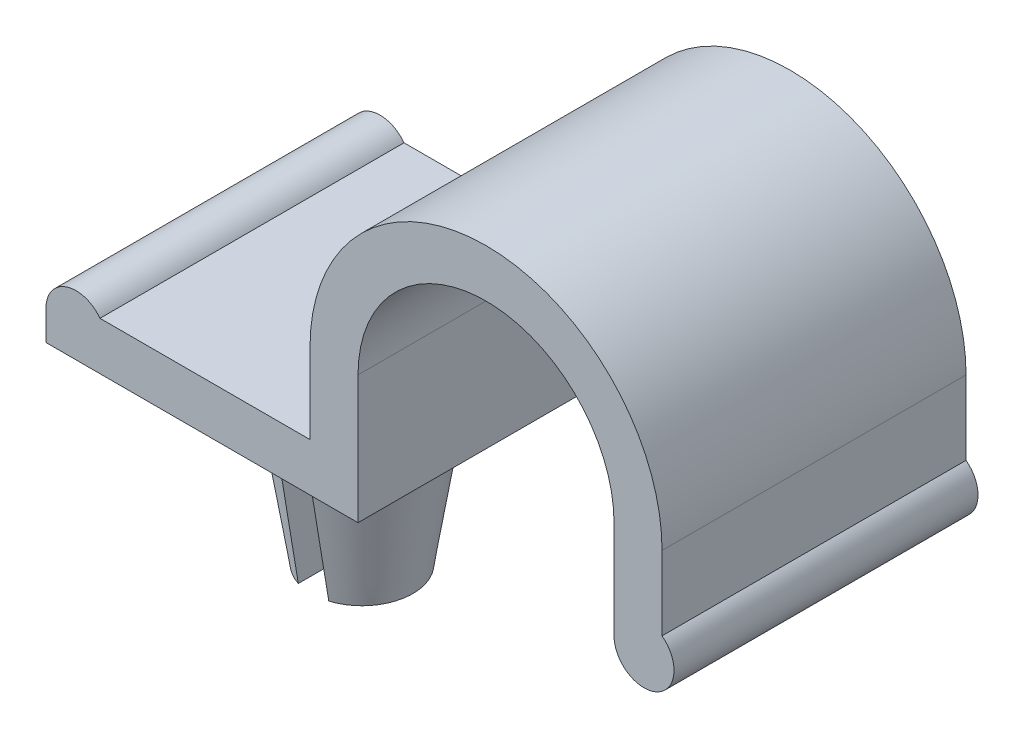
ISO-10303-21;
HEADER;
FILE_DESCRIPTION(('STEP AP214'),'2;1');
FILE_NAME('part.step','',(''),(''),'','','');
FILE_SCHEMA(('AUTOMOTIVE_DESIGN { 1 0 10303 214 1 1 1 1 }'));
ENDSEC;
DATA;
#1=APPLICATION_CONTEXT('core data for automotive mechanical design processes');
#2=APPLICATION_PROTOCOL_DEFINITION('international standard','automotive_design',2000,#1);
#3=PRODUCT_CONTEXT('',#1,'mechanical');
#4=PRODUCT('Part','Part','',(#3));
#5=PRODUCT_RELATED_PRODUCT_CATEGORY('part','',(#4));
#6=PRODUCT_DEFINITION_FORMATION('','',#4);
#7=PRODUCT_DEFINITION_CONTEXT('part definition',#1,'design');
#8=PRODUCT_DEFINITION('design','',#6,#7);
#9=PRODUCT_DEFINITION_SHAPE('','',#8);
#10=(LENGTH_UNIT() NAMED_UNIT(*) SI_UNIT(.MILLI.,.METRE.));
#11=(NAMED_UNIT(*) PLANE_ANGLE_UNIT() SI_UNIT($,.RADIAN.));
#12=(NAMED_UNIT(*) SI_UNIT($,.STERADIAN.) SOLID_ANGLE_UNIT());
#13=UNCERTAINTY_MEASURE_WITH_UNIT(LENGTH_MEASURE(1.E-05),#10,'distance_accuracy_value','');
#14=(GEOMETRIC_REPRESENTATION_CONTEXT(3) GLOBAL_UNCERTAINTY_ASSIGNED_CONTEXT((#13)) GLOBAL_UNIT_ASSIGNED_CONTEXT((#10,
#11,#12)) REPRESENTATION_CONTEXT('',''));
#15=CARTESIAN_POINT('',(0.,0.,0.));
#16=DIRECTION('',(0.,0.,1.));
#17=DIRECTION('',(1.,0.,0.));
#18=AXIS2_PLACEMENT_3D('',#15,#16,#17);
#19=CARTESIAN_POINT('',(-5.15,-4.851,0.));
#20=DIRECTION('',(0.,1.,0.));
#21=DIRECTION('',(0.,0.,1.));
#22=AXIS2_PLACEMENT_3D('',#19,#20,#21);
#23=PLANE('',#22);
#24=DIRECTION('',(0.,0.,1.));
#25=VECTOR('',#24,1.);
#26=CARTESIAN_POINT('',(-7.281,-4.851,0.));
#27=LINE('',#26,#25);
#28=CARTESIAN_POINT('',(-7.281,-4.851,-1.7080219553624));
#29=VERTEX_POINT('',#28);
#30=CARTESIAN_POINT('',(-7.281,-4.851,-1.45080632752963));
#31=VERTEX_POINT('',#30);
#32=EDGE_CURVE('E273',#29,#31,#27,.T.);
#33=ORIENTED_EDGE('',*,*,#32,.F.);
#34=CARTESIAN_POINT('',(-6.9,-4.851,0.));
#35=DIRECTION('',(0.,-1.,0.));
#36=DIRECTION('',(0.,0.,-1.));
#37=AXIS2_PLACEMENT_3D('',#34,#35,#36);
#38=CIRCLE('',#37,1.75);
#39=CARTESIAN_POINT('',(-7.281,-4.851,1.7080219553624));
#40=VERTEX_POINT('',#39);
#41=EDGE_CURVE('E288',#40,#29,#38,.T.);
#42=ORIENTED_EDGE('',*,*,#41,.F.);
#43=CARTESIAN_POINT('',(-7.281,-4.851,1.45080632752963));
#44=VERTEX_POINT('',#43);
#45=EDGE_CURVE('E269',#44,#40,#27,.T.);
#46=ORIENTED_EDGE('',*,*,#45,.F.);
#47=CARTESIAN_POINT('',(-6.9,-4.851,0.));
#48=DIRECTION('',(0.,-1.,0.));
#49=DIRECTION('',(0.,0.,-1.));
#50=AXIS2_PLACEMENT_3D('',#47,#48,#49);
#51=CIRCLE('',#50,1.5);
#52=EDGE_CURVE('E292',#44,#31,#51,.T.);
#53=ORIENTED_EDGE('',*,*,#52,.T.);
#54=EDGE_LOOP('',(#33,#42,#46,#53));
#55=FACE_BOUND('',#54,.T.);
#56=ADVANCED_FACE('F30',(#55),#23,.T.);
#57=CARTESIAN_POINT('',(-6.9,-7.851,0.));
#58=DIRECTION('',(0.,1.,0.));
#59=DIRECTION('',(0.,0.,1.));
#60=AXIS2_PLACEMENT_3D('',#57,#58,#59);
#61=CONICAL_SURFACE('',#60,1.27,0.158655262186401);
#62=CARTESIAN_POINT('',(-7.281,-9.73613459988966,-0.890278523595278));
#63=CARTESIAN_POINT('',(-7.281,-9.46150185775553,-0.938041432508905));
#64=CARTESIAN_POINT('',(-7.281,-9.18678117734,-0.985293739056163));
#65=CARTESIAN_POINT('',(-7.281,-8.63721103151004,-1.07903998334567));
#66=CARTESIAN_POINT('',(-7.281,-8.36236156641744,-1.12553392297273));
#67=CARTESIAN_POINT('',(-7.281,-7.88160254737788,-1.20641442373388));
#68=CARTESIAN_POINT('',(-7.281,-7.67571123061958,-1.24090973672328));
#69=CARTESIAN_POINT('',(-7.281,-7.09190160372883,-1.33840204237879));
#70=CARTESIAN_POINT('',(-7.281,-6.71393986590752,-1.40113905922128));
#71=CARTESIAN_POINT('',(-7.281,-5.95793592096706,-1.5261278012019));
#72=CARTESIAN_POINT('',(-7.281,-5.57989371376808,-1.5883795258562));
#73=CARTESIAN_POINT('',(-7.281,-4.49764082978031,-1.76609832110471));
#74=CARTESIAN_POINT('',(-7.281,-3.79336198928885,-1.88115016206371));
#75=CARTESIAN_POINT('',(-7.281,-2.38469774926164,-2.11060056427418));
#76=CARTESIAN_POINT('',(-7.281,-1.68031234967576,-2.22499912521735));
#77=CARTESIAN_POINT('',(-7.281,-0.271480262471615,-2.45338420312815));
#78=CARTESIAN_POINT('',(-7.281,0.432966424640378,-2.56737072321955));
#79=CARTESIAN_POINT('',(-7.281,1.84190503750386,-2.79505928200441));
#80=CARTESIAN_POINT('',(-7.281,2.5463969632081,-2.9087613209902));
#81=CARTESIAN_POINT('',(-7.281,3.25090153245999,-3.02238458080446));
#82=B_SPLINE_CURVE_WITH_KNOTS('',3,(#62,#63,#64,#65,#66,#67,#68,#69,#70,#71,#72,#73,#74,#75,#76,
#77,#78,#79,#80,#81),.UNSPECIFIED.,.F.,.F.,(4,2,2,2,2,2,2,2,2,4),(0.,0.836263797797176,
1.6725255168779,2.2988084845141,3.44820731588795,4.59760729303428,6.73845001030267,
8.87929373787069,11.0201212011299,13.1609464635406),.UNSPECIFIED.);
#83=CARTESIAN_POINT('',(-7.281,-7.851,-1.21150278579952));
#84=VERTEX_POINT('',#83);
#85=EDGE_CURVE('E275',#84,#29,#82,.T.);
#86=ORIENTED_EDGE('',*,*,#85,.F.);
#87=CARTESIAN_POINT('',(-6.9,-7.851,0.));
#88=DIRECTION('',(0.,-1.,0.));
#89=DIRECTION('',(0.,0.,-1.));
#90=AXIS2_PLACEMENT_3D('',#87,#88,#89);
#91=CIRCLE('',#90,1.27);
#92=CARTESIAN_POINT('',(-7.281,-7.851,1.21150278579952));
#93=VERTEX_POINT('',#92);
#94=EDGE_CURVE('E284',#93,#84,#91,.T.);
#95=ORIENTED_EDGE('',*,*,#94,.F.);
#96=CARTESIAN_POINT('',(-7.281,-9.73613459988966,0.890278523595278));
#97=CARTESIAN_POINT('',(-7.281,-9.46150185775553,0.938041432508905));
#98=CARTESIAN_POINT('',(-7.281,-9.18678117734,0.985293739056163));
#99=CARTESIAN_POINT('',(-7.281,-8.63721103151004,1.07903998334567));
#100=CARTESIAN_POINT('',(-7.281,-8.36236156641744,1.12553392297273));
#101=CARTESIAN_POINT('',(-7.281,-7.88160254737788,1.20641442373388));
#102=CARTESIAN_POINT('',(-7.281,-7.67571123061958,1.24090973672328));
#103=CARTESIAN_POINT('',(-7.281,-7.09190160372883,1.33840204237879));
#104=CARTESIAN_POINT('',(-7.281,-6.71393986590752,1.40113905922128));
#105=CARTESIAN_POINT('',(-7.281,-5.95793592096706,1.5261278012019));
#106=CARTESIAN_POINT('',(-7.281,-5.57989371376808,1.5883795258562));
#107=CARTESIAN_POINT('',(-7.281,-4.49764082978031,1.76609832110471));
#108=CARTESIAN_POINT('',(-7.281,-3.79336198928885,1.88115016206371));
#109=CARTESIAN_POINT('',(-7.281,-2.38469774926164,2.11060056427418));
#110=CARTESIAN_POINT('',(-7.281,-1.68031234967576,2.22499912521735));
#111=CARTESIAN_POINT('',(-7.281,-0.271480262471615,2.45338420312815));
#112=CARTESIAN_POINT('',(-7.281,0.432966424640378,2.56737072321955));
#113=CARTESIAN_POINT('',(-7.281,1.84190503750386,2.79505928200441));
#114=CARTESIAN_POINT('',(-7.281,2.5463969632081,2.9087613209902));
#115=CARTESIAN_POINT('',(-7.281,3.25090153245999,3.02238458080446));
#116=B_SPLINE_CURVE_WITH_KNOTS('',3,(#96,#97,#98,#99,#100,#101,#102,#103,#104,#105,#106,#107,
#108,#109,#110,#111,#112,#113,#114,#115),.UNSPECIFIED.,.F.,.F.,(4,2,2,2,2,2,2,2,2,4),(0.,
0.836263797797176,1.6725255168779,2.2988084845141,3.44820731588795,4.59760729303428,
6.73845001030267,8.87929373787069,11.0201212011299,13.1609464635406),.UNSPECIFIED.);
#117=EDGE_CURVE('E263',#40,#93,#116,.F.);
#118=ORIENTED_EDGE('',*,*,#117,.F.);
#119=ORIENTED_EDGE('',*,*,#41,.T.);
#120=EDGE_LOOP('',(#86,#95,#118,#119));
#121=FACE_BOUND('',#120,.T.);
#122=ADVANCED_FACE('F258',(#121),#61,.T.);
#123=CARTESIAN_POINT('',(-6.9,-7.851,0.));
#124=DIRECTION('',(0.,-1.,0.));
#125=DIRECTION('',(0.,0.,-1.));
#126=AXIS2_PLACEMENT_3D('',#123,#124,#125);
#127=PLANE('',#126);
#128=DIRECTION('',(0.,0.,-1.));
#129=VECTOR('',#128,1.);
#130=CARTESIAN_POINT('',(-7.281,-7.851,0.));
#131=LINE('',#130,#129);
#132=EDGE_CURVE('E210',#93,#84,#131,.T.);
#133=ORIENTED_EDGE('',*,*,#132,.F.);
#134=ORIENTED_EDGE('',*,*,#94,.T.);
#135=EDGE_LOOP('',(#133,#134));
#136=FACE_BOUND('',#135,.T.);
#137=ADVANCED_FACE('F358',(#136),#127,.T.);
#138=CARTESIAN_POINT('',(-3.2,-3.2,3.8));
#139=DIRECTION('',(0.,1.,0.));
#140=DIRECTION('',(-1.,0.,0.));
#141=AXIS2_PLACEMENT_3D('',#138,#139,#140);
#142=PLANE('',#141);
#143=CARTESIAN_POINT('',(-6.9,-3.2,0.));
#144=DIRECTION('',(0.,-1.,0.));
#145=DIRECTION('',(0.,0.,-1.));
#146=AXIS2_PLACEMENT_3D('',#143,#144,#145);
#147=CIRCLE('',#146,1.5);
#148=CARTESIAN_POINT('',(-6.9,-3.2,-1.5));
#149=VERTEX_POINT('',#148);
#150=EDGE_CURVE('E166',#149,#149,#147,.T.);
#151=ORIENTED_EDGE('',*,*,#150,.F.);
#152=EDGE_LOOP('',(#151));
#153=FACE_BOUND('',#152,.T.);
#154=DIRECTION('',(1.,0.,0.));
#155=VECTOR('',#154,1.);
#156=CARTESIAN_POINT('',(-3.2,-3.2,-3.8));
#157=LINE('',#156,#155);
#158=CARTESIAN_POINT('',(-11.,-3.2,-3.8));
#159=VERTEX_POINT('',#158);
#160=CARTESIAN_POINT('',(-3.2,-3.2,-3.8));
#161=VERTEX_POINT('',#160);
#162=EDGE_CURVE('E162',#159,#161,#157,.T.);
#163=ORIENTED_EDGE('',*,*,#162,.T.);
#164=DIRECTION('',(0.,0.,-1.));
#165=VECTOR('',#164,1.);
#166=CARTESIAN_POINT('',(-3.2,-3.2,3.8));
#167=LINE('',#166,#165);
#168=CARTESIAN_POINT('',(-3.2,-3.2,3.8));
#169=VERTEX_POINT('',#168);
#170=EDGE_CURVE('E206',#169,#161,#167,.T.);
#171=ORIENTED_EDGE('',*,*,#170,.F.);
#172=DIRECTION('',(1.,0.,0.));
#173=VECTOR('',#172,1.);
#174=CARTESIAN_POINT('',(-3.2,-3.2,3.8));
#175=LINE('',#174,#173);
#176=CARTESIAN_POINT('',(-11.,-3.2,3.8));
#177=VERTEX_POINT('',#176);
#178=EDGE_CURVE('E184',#177,#169,#175,.T.);
#179=ORIENTED_EDGE('',*,*,#178,.F.);
#180=DIRECTION('',(0.,0.,-1.));
#181=VECTOR('',#180,1.);
#182=CARTESIAN_POINT('',(-11.,-3.2,3.8));
#183=LINE('',#182,#181);
#184=EDGE_CURVE('E158',#177,#159,#183,.T.);
#185=ORIENTED_EDGE('',*,*,#184,.T.);
#186=EDGE_LOOP('',(#163,#171,#179,#185));
#187=FACE_BOUND('',#186,.T.);
#188=ADVANCED_FACE('F32',(#153,#187),#142,.F.);
#189=CARTESIAN_POINT('',(-3.2,0.,3.8));
#190=DIRECTION('',(-1.,0.,0.));
#191=DIRECTION('',(0.,-1.,0.));
#192=AXIS2_PLACEMENT_3D('',#189,#190,#191);
#193=PLANE('',#192);
#194=DIRECTION('',(0.,1.,0.));
#195=VECTOR('',#194,1.);
#196=CARTESIAN_POINT('',(-3.2,0.,-3.8));
#197=LINE('',#196,#195);
#198=CARTESIAN_POINT('',(-3.2,0.,-3.8));
#199=VERTEX_POINT('',#198);
#200=EDGE_CURVE('E165',#161,#199,#197,.T.);
#201=ORIENTED_EDGE('',*,*,#200,.T.);
#202=DIRECTION('',(0.,0.,-1.));
#203=VECTOR('',#202,1.);
#204=CARTESIAN_POINT('',(-3.2,0.,3.8));
#205=LINE('',#204,#203);
#206=CARTESIAN_POINT('',(-3.2,0.,3.8));
#207=VERTEX_POINT('',#206);
#208=EDGE_CURVE('E203',#207,#199,#205,.T.);
#209=ORIENTED_EDGE('',*,*,#208,.F.);
#210=DIRECTION('',(0.,1.,0.));
#211=VECTOR('',#210,1.);
#212=CARTESIAN_POINT('',(-3.2,0.,3.8));
#213=LINE('',#212,#211);
#214=EDGE_CURVE('E110',#169,#207,#213,.T.);
#215=ORIENTED_EDGE('',*,*,#214,.F.);
#216=ORIENTED_EDGE('',*,*,#170,.T.);
#217=EDGE_LOOP('',(#201,#209,#215,#216));
#218=FACE_BOUND('',#217,.T.);
#219=ADVANCED_FACE('F328',(#218),#193,.F.);
#220=CARTESIAN_POINT('',(0.,0.,3.8));
#221=DIRECTION('',(0.,0.,-1.));
#222=DIRECTION('',(-1.,0.,0.));
#223=AXIS2_PLACEMENT_3D('',#220,#221,#222);
#224=CYLINDRICAL_SURFACE('',#223,3.2);
#225=CARTESIAN_POINT('',(0.,0.,-3.8));
#226=DIRECTION('',(0.,0.,-1.));
#227=DIRECTION('',(1.,0.,0.));
#228=AXIS2_PLACEMENT_3D('',#225,#226,#227);
#229=CIRCLE('',#228,3.2);
#230=CARTESIAN_POINT('',(3.2,0.,-3.8));
#231=VERTEX_POINT('',#230);
#232=EDGE_CURVE('E168',#199,#231,#229,.T.);
#233=ORIENTED_EDGE('',*,*,#232,.T.);
#234=DIRECTION('',(0.,0.,-1.));
#235=VECTOR('',#234,1.);
#236=CARTESIAN_POINT('',(3.2,0.,3.8));
#237=LINE('',#236,#235);
#238=CARTESIAN_POINT('',(3.2,0.,3.8));
#239=VERTEX_POINT('',#238);
#240=EDGE_CURVE('E200',#239,#231,#237,.T.);
#241=ORIENTED_EDGE('',*,*,#240,.F.);
#242=CARTESIAN_POINT('',(0.,0.,3.8));
#243=DIRECTION('',(0.,0.,-1.));
#244=DIRECTION('',(1.,0.,0.));
#245=AXIS2_PLACEMENT_3D('',#242,#243,#244);
#246=CIRCLE('',#245,3.2);
#247=EDGE_CURVE('E300',#207,#239,#246,.T.);
#248=ORIENTED_EDGE('',*,*,#247,.F.);
#249=ORIENTED_EDGE('',*,*,#208,.T.);
#250=EDGE_LOOP('',(#233,#241,#248,#249));
#251=FACE_BOUND('',#250,.T.);
#252=ADVANCED_FACE('F331',(#251),#224,.F.);
#253=CARTESIAN_POINT('',(3.2,0.,3.8));
#254=DIRECTION('',(1.,0.,0.));
#255=DIRECTION('',(0.,1.,0.));
#256=AXIS2_PLACEMENT_3D('',#253,#254,#255);
#257=PLANE('',#256);
#258=DIRECTION('',(0.,-1.,0.));
#259=VECTOR('',#258,1.);
#260=CARTESIAN_POINT('',(3.2,0.,-3.8));
#261=LINE('',#260,#259);
#262=CARTESIAN_POINT('',(3.2,-2.45,-3.8));
#263=VERTEX_POINT('',#262);
#264=EDGE_CURVE('E170',#231,#263,#261,.T.);
#265=ORIENTED_EDGE('',*,*,#264,.T.);
#266=DIRECTION('',(0.,0.,-1.));
#267=VECTOR('',#266,1.);
#268=CARTESIAN_POINT('',(3.2,-2.45,3.8));
#269=LINE('',#268,#267);
#270=CARTESIAN_POINT('',(3.2,-2.45,3.8));
#271=VERTEX_POINT('',#270);
#272=EDGE_CURVE('E197',#271,#263,#269,.T.);
#273=ORIENTED_EDGE('',*,*,#272,.F.);
#274=DIRECTION('',(0.,-1.,0.));
#275=VECTOR('',#274,1.);
#276=CARTESIAN_POINT('',(3.2,0.,3.8));
#277=LINE('',#276,#275);
#278=EDGE_CURVE('E302',#239,#271,#277,.T.);
#279=ORIENTED_EDGE('',*,*,#278,.F.);
#280=ORIENTED_EDGE('',*,*,#240,.T.);
#281=EDGE_LOOP('',(#265,#273,#279,#280));
#282=FACE_BOUND('',#281,.T.);
#283=ADVANCED_FACE('F336',(#282),#257,.F.);
#284=CARTESIAN_POINT('',(3.95,-2.45,3.8));
#285=DIRECTION('',(0.,0.,-1.));
#286=DIRECTION('',(-1.,0.,0.));
#287=AXIS2_PLACEMENT_3D('',#284,#285,#286);
#288=CYLINDRICAL_SURFACE('',#287,0.75);
#289=CARTESIAN_POINT('',(3.95,-2.45,-3.8));
#290=DIRECTION('',(0.,0.,1.));
#291=DIRECTION('',(1.,0.,0.));
#292=AXIS2_PLACEMENT_3D('',#289,#290,#291);
#293=CIRCLE('',#292,0.75);
#294=CARTESIAN_POINT('',(4.4,-1.85,-3.8));
#295=VERTEX_POINT('',#294);
#296=EDGE_CURVE('E172',#263,#295,#293,.T.);
#297=ORIENTED_EDGE('',*,*,#296,.T.);
#298=DIRECTION('',(0.,0.,-1.));
#299=VECTOR('',#298,1.);
#300=CARTESIAN_POINT('',(4.4,-1.85,3.8));
#301=LINE('',#300,#299);
#302=CARTESIAN_POINT('',(4.4,-1.85,3.8));
#303=VERTEX_POINT('',#302);
#304=EDGE_CURVE('E194',#303,#295,#301,.T.);
#305=ORIENTED_EDGE('',*,*,#304,.F.);
#306=CARTESIAN_POINT('',(3.95,-2.45,3.8));
#307=DIRECTION('',(0.,0.,1.));
#308=DIRECTION('',(1.,0.,0.));
#309=AXIS2_PLACEMENT_3D('',#306,#307,#308);
#310=CIRCLE('',#309,0.75);
#311=EDGE_CURVE('E304',#271,#303,#310,.T.);
#312=ORIENTED_EDGE('',*,*,#311,.F.);
#313=ORIENTED_EDGE('',*,*,#272,.T.);
#314=EDGE_LOOP('',(#297,#305,#312,#313));
#315=FACE_BOUND('',#314,.T.);
#316=ADVANCED_FACE('F340',(#315),#288,.T.);
#317=CARTESIAN_POINT('',(4.4,0.,3.8));
#318=DIRECTION('',(-1.,0.,0.));
#319=DIRECTION('',(0.,0.,1.));
#320=AXIS2_PLACEMENT_3D('',#317,#318,#319);
#321=PLANE('',#320);
#322=DIRECTION('',(0.,1.,0.));
#323=VECTOR('',#322,1.);
#324=CARTESIAN_POINT('',(4.4,0.,-3.8));
#325=LINE('',#324,#323);
#326=CARTESIAN_POINT('',(4.4,0.,-3.8));
#327=VERTEX_POINT('',#326);
#328=EDGE_CURVE('E174',#295,#327,#325,.T.);
#329=ORIENTED_EDGE('',*,*,#328,.T.);
#330=DIRECTION('',(0.,0.,-1.));
#331=VECTOR('',#330,1.);
#332=CARTESIAN_POINT('',(4.4,0.,3.8));
#333=LINE('',#332,#331);
#334=CARTESIAN_POINT('',(4.4,0.,3.8));
#335=VERTEX_POINT('',#334);
#336=EDGE_CURVE('E191',#335,#327,#333,.T.);
#337=ORIENTED_EDGE('',*,*,#336,.F.);
#338=DIRECTION('',(0.,1.,0.));
#339=VECTOR('',#338,1.);
#340=CARTESIAN_POINT('',(4.4,0.,3.8));
#341=LINE('',#340,#339);
#342=EDGE_CURVE('E306',#303,#335,#341,.T.);
#343=ORIENTED_EDGE('',*,*,#342,.F.);
#344=ORIENTED_EDGE('',*,*,#304,.T.);
#345=EDGE_LOOP('',(#329,#337,#343,#344));
#346=FACE_BOUND('',#345,.T.);
#347=ADVANCED_FACE('F344',(#346),#321,.F.);
#348=CARTESIAN_POINT('',(0.,0.,3.8));
#349=DIRECTION('',(0.,0.,-1.));
#350=DIRECTION('',(-1.,0.,0.));
#351=AXIS2_PLACEMENT_3D('',#348,#349,#350);
#352=CYLINDRICAL_SURFACE('',#351,4.4);
#353=CARTESIAN_POINT('',(0.,0.,-3.8));
#354=DIRECTION('',(0.,0.,1.));
#355=DIRECTION('',(1.,0.,0.));
#356=AXIS2_PLACEMENT_3D('',#353,#354,#355);
#357=CIRCLE('',#356,4.4);
#358=CARTESIAN_POINT('',(-4.4,0.,-3.8));
#359=VERTEX_POINT('',#358);
#360=EDGE_CURVE('E176',#327,#359,#357,.T.);
#361=ORIENTED_EDGE('',*,*,#360,.T.);
#362=DIRECTION('',(0.,0.,-1.));
#363=VECTOR('',#362,1.);
#364=CARTESIAN_POINT('',(-4.4,0.,3.8));
#365=LINE('',#364,#363);
#366=CARTESIAN_POINT('',(-4.4,0.,3.8));
#367=VERTEX_POINT('',#366);
#368=EDGE_CURVE('E188',#367,#359,#365,.T.);
#369=ORIENTED_EDGE('',*,*,#368,.F.);
#370=CARTESIAN_POINT('',(0.,0.,3.8));
#371=DIRECTION('',(0.,0.,1.));
#372=DIRECTION('',(1.,0.,0.));
#373=AXIS2_PLACEMENT_3D('',#370,#371,#372);
#374=CIRCLE('',#373,4.4);
#375=EDGE_CURVE('E308',#335,#367,#374,.T.);
#376=ORIENTED_EDGE('',*,*,#375,.F.);
#377=ORIENTED_EDGE('',*,*,#336,.T.);
#378=EDGE_LOOP('',(#361,#369,#376,#377));
#379=FACE_BOUND('',#378,.T.);
#380=ADVANCED_FACE('F314',(#379),#352,.T.);
#381=CARTESIAN_POINT('',(-4.4,0.,3.8));
#382=DIRECTION('',(1.,0.,0.));
#383=DIRECTION('',(0.,0.,-1.));
#384=AXIS2_PLACEMENT_3D('',#381,#382,#383);
#385=PLANE('',#384);
#386=DIRECTION('',(0.,-1.,0.));
#387=VECTOR('',#386,1.);
#388=CARTESIAN_POINT('',(-4.4,0.,-3.8));
#389=LINE('',#388,#387);
#390=CARTESIAN_POINT('',(-4.4,-2.,-3.8));
#391=VERTEX_POINT('',#390);
#392=EDGE_CURVE('E178',#359,#391,#389,.T.);
#393=ORIENTED_EDGE('',*,*,#392,.T.);
#394=DIRECTION('',(0.,0.,-1.));
#395=VECTOR('',#394,1.);
#396=CARTESIAN_POINT('',(-4.4,-2.,3.8));
#397=LINE('',#396,#395);
#398=CARTESIAN_POINT('',(-4.4,-2.,3.8));
#399=VERTEX_POINT('',#398);
#400=EDGE_CURVE('E153',#399,#391,#397,.T.);
#401=ORIENTED_EDGE('',*,*,#400,.F.);
#402=DIRECTION('',(0.,-1.,0.));
#403=VECTOR('',#402,1.);
#404=CARTESIAN_POINT('',(-4.4,0.,3.8));
#405=LINE('',#404,#403);
#406=EDGE_CURVE('E141',#367,#399,#405,.T.);
#407=ORIENTED_EDGE('',*,*,#406,.F.);
#408=ORIENTED_EDGE('',*,*,#368,.T.);
#409=EDGE_LOOP('',(#393,#401,#407,#408));
#410=FACE_BOUND('',#409,.T.);
#411=ADVANCED_FACE('F318',(#410),#385,.F.);
#412=CARTESIAN_POINT('',(-9.65,-2.,3.8));
#413=DIRECTION('',(0.,-1.,0.));
#414=DIRECTION('',(0.,0.,-1.));
#415=AXIS2_PLACEMENT_3D('',#412,#413,#414);
#416=PLANE('',#415);
#417=DIRECTION('',(-1.,0.,0.));
#418=VECTOR('',#417,1.);
#419=CARTESIAN_POINT('',(-9.65,-2.,-3.8));
#420=LINE('',#419,#418);
#421=CARTESIAN_POINT('',(-9.65,-2.,-3.8));
#422=VERTEX_POINT('',#421);
#423=EDGE_CURVE('E150',#391,#422,#420,.T.);
#424=ORIENTED_EDGE('',*,*,#423,.T.);
#425=DIRECTION('',(0.,0.,-1.));
#426=VECTOR('',#425,1.);
#427=CARTESIAN_POINT('',(-9.65,-2.,3.8));
#428=LINE('',#427,#426);
#429=CARTESIAN_POINT('',(-9.65,-2.,3.8));
#430=VERTEX_POINT('',#429);
#431=EDGE_CURVE('E147',#430,#422,#428,.T.);
#432=ORIENTED_EDGE('',*,*,#431,.F.);
#433=DIRECTION('',(-1.,0.,0.));
#434=VECTOR('',#433,1.);
#435=CARTESIAN_POINT('',(-9.65,-2.,3.8));
#436=LINE('',#435,#434);
#437=EDGE_CURVE('E134',#399,#430,#436,.T.);
#438=ORIENTED_EDGE('',*,*,#437,.F.);
#439=ORIENTED_EDGE('',*,*,#400,.T.);
#440=EDGE_LOOP('',(#424,#432,#438,#439));
#441=FACE_BOUND('',#440,.T.);
#442=ADVANCED_FACE('F148',(#441),#416,.F.);
#443=CARTESIAN_POINT('',(-10.25,-2.45,3.8));
#444=DIRECTION('',(0.,0.,-1.));
#445=DIRECTION('',(-1.,0.,0.));
#446=AXIS2_PLACEMENT_3D('',#443,#444,#445);
#447=CYLINDRICAL_SURFACE('',#446,0.750000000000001);
#448=CARTESIAN_POINT('',(-10.25,-2.45,-3.8));
#449=DIRECTION('',(0.,0.,1.));
#450=DIRECTION('',(1.,0.,0.));
#451=AXIS2_PLACEMENT_3D('',#448,#449,#450);
#452=CIRCLE('',#451,0.750000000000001);
#453=CARTESIAN_POINT('',(-11.,-2.45,-3.8));
#454=VERTEX_POINT('',#453);
#455=EDGE_CURVE('E181',#422,#454,#452,.T.);
#456=ORIENTED_EDGE('',*,*,#455,.T.);
#457=DIRECTION('',(0.,0.,-1.));
#458=VECTOR('',#457,1.);
#459=CARTESIAN_POINT('',(-11.,-2.45,3.8));
#460=LINE('',#459,#458);
#461=CARTESIAN_POINT('',(-11.,-2.45,3.8));
#462=VERTEX_POINT('',#461);
#463=EDGE_CURVE('E154',#462,#454,#460,.T.);
#464=ORIENTED_EDGE('',*,*,#463,.F.);
#465=CARTESIAN_POINT('',(-10.25,-2.45,3.8));
#466=DIRECTION('',(0.,0.,1.));
#467=DIRECTION('',(1.,0.,0.));
#468=AXIS2_PLACEMENT_3D('',#465,#466,#467);
#469=CIRCLE('',#468,0.750000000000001);
#470=EDGE_CURVE('E138',#430,#462,#469,.T.);
#471=ORIENTED_EDGE('',*,*,#470,.F.);
#472=ORIENTED_EDGE('',*,*,#431,.T.);
#473=EDGE_LOOP('',(#456,#464,#471,#472));
#474=FACE_BOUND('',#473,.T.);
#475=ADVANCED_FACE('F156',(#474),#447,.T.);
#476=CARTESIAN_POINT('',(-11.,-3.2,3.8));
#477=DIRECTION('',(1.,0.,0.));
#478=DIRECTION('',(0.,0.,-1.));
#479=AXIS2_PLACEMENT_3D('',#476,#477,#478);
#480=PLANE('',#479);
#481=DIRECTION('',(0.,-1.,0.));
#482=VECTOR('',#481,1.);
#483=CARTESIAN_POINT('',(-11.,-3.2,-3.8));
#484=LINE('',#483,#482);
#485=EDGE_CURVE('E101',#454,#159,#484,.T.);
#486=ORIENTED_EDGE('',*,*,#485,.T.);
#487=ORIENTED_EDGE('',*,*,#184,.F.);
#488=DIRECTION('',(0.,-1.,0.));
#489=VECTOR('',#488,1.);
#490=CARTESIAN_POINT('',(-11.,-3.2,3.8));
#491=LINE('',#490,#489);
#492=EDGE_CURVE('E59',#462,#177,#491,.T.);
#493=ORIENTED_EDGE('',*,*,#492,.F.);
#494=ORIENTED_EDGE('',*,*,#463,.T.);
#495=EDGE_LOOP('',(#486,#487,#493,#494));
#496=FACE_BOUND('',#495,.T.);
#497=ADVANCED_FACE('F322',(#496),#480,.F.);
#498=CARTESIAN_POINT('',(-10.25,-2.45,3.8));
#499=DIRECTION('',(0.,0.,1.));
#500=DIRECTION('',(1.,0.,0.));
#501=AXIS2_PLACEMENT_3D('',#498,#499,#500);
#502=PLANE('',#501);
#503=ORIENTED_EDGE('',*,*,#178,.T.);
#504=ORIENTED_EDGE('',*,*,#214,.T.);
#505=ORIENTED_EDGE('',*,*,#247,.T.);
#506=ORIENTED_EDGE('',*,*,#278,.T.);
#507=ORIENTED_EDGE('',*,*,#311,.T.);
#508=ORIENTED_EDGE('',*,*,#342,.T.);
#509=ORIENTED_EDGE('',*,*,#375,.T.);
#510=ORIENTED_EDGE('',*,*,#406,.T.);
#511=ORIENTED_EDGE('',*,*,#437,.T.);
#512=ORIENTED_EDGE('',*,*,#470,.T.);
#513=ORIENTED_EDGE('',*,*,#492,.T.);
#514=EDGE_LOOP('',(#503,#504,#505,#506,#507,#508,#509,#510,#511,#512,#513));
#515=FACE_BOUND('',#514,.T.);
#516=ADVANCED_FACE('F136',(#515),#502,.T.);
#517=CARTESIAN_POINT('',(-10.25,-2.45,-3.8));
#518=DIRECTION('',(0.,0.,1.));
#519=DIRECTION('',(1.,0.,0.));
#520=AXIS2_PLACEMENT_3D('',#517,#518,#519);
#521=PLANE('',#520);
#522=ORIENTED_EDGE('',*,*,#162,.F.);
#523=ORIENTED_EDGE('',*,*,#485,.F.);
#524=ORIENTED_EDGE('',*,*,#455,.F.);
#525=ORIENTED_EDGE('',*,*,#423,.F.);
#526=ORIENTED_EDGE('',*,*,#392,.F.);
#527=ORIENTED_EDGE('',*,*,#360,.F.);
#528=ORIENTED_EDGE('',*,*,#328,.F.);
#529=ORIENTED_EDGE('',*,*,#296,.F.);
#530=ORIENTED_EDGE('',*,*,#264,.F.);
#531=ORIENTED_EDGE('',*,*,#232,.F.);
#532=ORIENTED_EDGE('',*,*,#200,.F.);
#533=EDGE_LOOP('',(#522,#523,#524,#525,#526,#527,#528,#529,#530,#531,#532));
#534=FACE_BOUND('',#533,.T.);
#535=ADVANCED_FACE('F321',(#534),#521,.F.);
#536=CARTESIAN_POINT('',(-6.9,-3.2,0.));
#537=DIRECTION('',(0.,-1.,0.));
#538=DIRECTION('',(0.,0.,-1.));
#539=AXIS2_PLACEMENT_3D('',#536,#537,#538);
#540=CYLINDRICAL_SURFACE('',#539,1.5);
#541=DIRECTION('',(0.,-1.,0.));
#542=VECTOR('',#541,1.);
#543=CARTESIAN_POINT('',(-7.281,-3.2,1.45080632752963));
#544=LINE('',#543,#542);
#545=CARTESIAN_POINT('',(-7.281,-3.787,1.45080632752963));
#546=VERTEX_POINT('',#545);
#547=EDGE_CURVE('E272',#546,#44,#544,.T.);
#548=ORIENTED_EDGE('',*,*,#547,.F.);
#549=CARTESIAN_POINT('',(-6.519,-3.787,1.45080632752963));
#550=CARTESIAN_POINT('',(-6.51898021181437,-3.76593359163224,1.45078805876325));
#551=CARTESIAN_POINT('',(-6.52074585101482,-3.74488063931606,1.4512647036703));
#552=CARTESIAN_POINT('',(-6.52769226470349,-3.70342626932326,1.45306907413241));
#553=CARTESIAN_POINT('',(-6.53286595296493,-3.68302359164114,1.45439503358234));
#554=CARTESIAN_POINT('',(-6.54647314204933,-3.64340447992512,1.45776015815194));
#555=CARTESIAN_POINT('',(-6.5549062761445,-3.62418791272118,1.45979924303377));
#556=CARTESIAN_POINT('',(-6.57477546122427,-3.5874346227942,1.46435421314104));
#557=CARTESIAN_POINT('',(-6.58621236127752,-3.56989837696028,1.46687023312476));
#558=CARTESIAN_POINT('',(-6.61204069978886,-3.53661386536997,1.47216033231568));
#559=CARTESIAN_POINT('',(-6.62648748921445,-3.52090920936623,1.47493861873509));
#560=CARTESIAN_POINT('',(-6.65780717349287,-3.49211663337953,1.48040366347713));
#561=CARTESIAN_POINT('',(-6.67468045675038,-3.47902913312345,1.48309040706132));
#562=CARTESIAN_POINT('',(-6.71067518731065,-3.45566331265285,1.4881164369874));
#563=CARTESIAN_POINT('',(-6.72982555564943,-3.44542824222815,1.49045015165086));
#564=CARTESIAN_POINT('',(-6.76964325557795,-3.42833965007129,1.49445872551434));
#565=CARTESIAN_POINT('',(-6.79031028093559,-3.42148544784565,1.49613371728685));
#566=CARTESIAN_POINT('',(-6.83211775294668,-3.41149336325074,1.49860640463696));
#567=CARTESIAN_POINT('',(-6.85323931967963,-3.40828091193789,1.49942167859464));
#568=CARTESIAN_POINT('',(-6.89573673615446,-3.40542930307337,1.5001443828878));
#569=CARTESIAN_POINT('',(-6.91711255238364,-3.40578967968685,1.50005193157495));
#570=CARTESIAN_POINT('',(-6.95899311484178,-3.41002026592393,1.49898260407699));
#571=CARTESIAN_POINT('',(-6.97950659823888,-3.41380989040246,1.49802603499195));
#572=CARTESIAN_POINT('',(-7.0195961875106,-3.4246616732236,1.49535968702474));
#573=CARTESIAN_POINT('',(-7.03917225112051,-3.43172397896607,1.49364987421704));
#574=CARTESIAN_POINT('',(-7.0770425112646,-3.44898512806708,1.48963828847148));
#575=CARTESIAN_POINT('',(-7.09532314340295,-3.45921243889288,1.48733117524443));
#576=CARTESIAN_POINT('',(-7.12993633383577,-3.48249144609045,1.48237493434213));
#577=CARTESIAN_POINT('',(-7.14626858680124,-3.49554358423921,1.47972575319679));
#578=CARTESIAN_POINT('',(-7.17700086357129,-3.52453095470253,1.47428665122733));
#579=CARTESIAN_POINT('',(-7.19133450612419,-3.54053628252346,1.47149486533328));
#580=CARTESIAN_POINT('',(-7.2171327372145,-3.5747572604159,1.46615174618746));
#581=CARTESIAN_POINT('',(-7.2285965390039,-3.59297351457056,1.46360047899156));
#582=CARTESIAN_POINT('',(-7.24837495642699,-3.63123567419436,1.45901985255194));
#583=CARTESIAN_POINT('',(-7.25667133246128,-3.65129137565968,1.45699353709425));
#584=CARTESIAN_POINT('',(-7.26974312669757,-3.69256510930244,1.45373180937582));
#585=CARTESIAN_POINT('',(-7.27452381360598,-3.71378135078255,1.45249521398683));
#586=CARTESIAN_POINT('',(-7.27864467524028,-3.74381872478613,1.45142316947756));
#587=CARTESIAN_POINT('',(-7.27952805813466,-3.75243679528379,1.45119222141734));
#588=CARTESIAN_POINT('',(-7.28070506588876,-3.76970187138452,1.45088386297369));
#589=CARTESIAN_POINT('',(-7.28099964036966,-3.77834880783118,1.45080620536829));
#590=CARTESIAN_POINT('',(-7.28100000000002,-3.78700000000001,1.45080632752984));
#591=B_SPLINE_CURVE_WITH_KNOTS('',3,(#549,#550,#551,#552,#553,#554,#555,#556,#557,#558,#559,
#560,#561,#562,#563,#564,#565,#566,#567,#568,#569,#570,#571,#572,#573,#574,#575,#576,#577,#578,
#579,#580,#581,#582,#583,#584,#585,#586,#587,#588,#589,#590),.UNSPECIFIED.,.F.,.F.,(4,2,2,2,2,2,
2,2,2,2,2,2,2,2,2,2,2,2,2,2,4),(0.,0.0630992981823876,0.126067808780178,0.189029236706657,
0.252008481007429,0.316268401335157,0.380538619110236,0.445736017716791,0.510920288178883,
0.574744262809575,0.638559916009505,0.700913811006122,0.763270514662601,0.82620523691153,
0.88914980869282,0.953845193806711,1.01855829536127,1.0836386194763,1.14862121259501,
1.17460290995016,1.20054267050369),.UNSPECIFIED.);
#592=CARTESIAN_POINT('',(-6.519,-3.787,1.45080632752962));
#593=VERTEX_POINT('',#592);
#594=EDGE_CURVE('E11',#593,#546,#591,.T.);
#595=ORIENTED_EDGE('',*,*,#594,.F.);
#596=DIRECTION('',(0.,-1.,0.));
#597=VECTOR('',#596,1.);
#598=CARTESIAN_POINT('',(-6.519,-3.2,1.45080632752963));
#599=LINE('',#598,#597);
#600=CARTESIAN_POINT('',(-6.519,-4.851,1.45080632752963));
#601=VERTEX_POINT('',#600);
#602=EDGE_CURVE('E249',#601,#593,#599,.F.);
#603=ORIENTED_EDGE('',*,*,#602,.F.);
#604=CARTESIAN_POINT('',(-6.519,-4.851,-1.45080632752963));
#605=VERTEX_POINT('',#604);
#606=EDGE_CURVE('E293',#605,#601,#51,.T.);
#607=ORIENTED_EDGE('',*,*,#606,.F.);
#608=DIRECTION('',(0.,-1.,0.));
#609=VECTOR('',#608,1.);
#610=CARTESIAN_POINT('',(-6.519,-3.2,-1.45080632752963));
#611=LINE('',#610,#609);
#612=CARTESIAN_POINT('',(-6.519,-3.787,-1.45080632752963));
#613=VERTEX_POINT('',#612);
#614=EDGE_CURVE('E250',#613,#605,#611,.T.);
#615=ORIENTED_EDGE('',*,*,#614,.F.);
#616=CARTESIAN_POINT('',(-7.281,-3.787,-1.45080632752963));
#617=CARTESIAN_POINT('',(-7.28101978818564,-3.76593359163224,-1.45078805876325));
#618=CARTESIAN_POINT('',(-7.27925414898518,-3.74488063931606,-1.4512647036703));
#619=CARTESIAN_POINT('',(-7.27230773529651,-3.70342626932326,-1.45306907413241));
#620=CARTESIAN_POINT('',(-7.26713404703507,-3.68302359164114,-1.45439503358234));
#621=CARTESIAN_POINT('',(-7.25352685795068,-3.64340447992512,-1.45776015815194));
#622=CARTESIAN_POINT('',(-7.2450937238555,-3.62418791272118,-1.45979924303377));
#623=CARTESIAN_POINT('',(-7.22522453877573,-3.5874346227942,-1.46435421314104));
#624=CARTESIAN_POINT('',(-7.21378763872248,-3.56989837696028,-1.46687023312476));
#625=CARTESIAN_POINT('',(-7.18795930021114,-3.53661386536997,-1.47216033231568));
#626=CARTESIAN_POINT('',(-7.17351251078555,-3.52090920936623,-1.47493861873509));
#627=CARTESIAN_POINT('',(-7.14219282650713,-3.49211663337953,-1.48040366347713));
#628=CARTESIAN_POINT('',(-7.12531954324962,-3.47902913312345,-1.48309040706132));
#629=CARTESIAN_POINT('',(-7.08932481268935,-3.45566331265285,-1.4881164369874));
#630=CARTESIAN_POINT('',(-7.07017444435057,-3.44542824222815,-1.49045015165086));
#631=CARTESIAN_POINT('',(-7.03035674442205,-3.42833965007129,-1.49445872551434));
#632=CARTESIAN_POINT('',(-7.00968971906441,-3.42148544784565,-1.49613371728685));
#633=CARTESIAN_POINT('',(-6.96788224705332,-3.41149336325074,-1.49860640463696));
#634=CARTESIAN_POINT('',(-6.94676068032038,-3.40828091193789,-1.49942167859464));
#635=CARTESIAN_POINT('',(-6.90426326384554,-3.40542930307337,-1.5001443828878));
#636=CARTESIAN_POINT('',(-6.88288744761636,-3.40578967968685,-1.50005193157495));
#637=CARTESIAN_POINT('',(-6.84100688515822,-3.41002026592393,-1.49898260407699));
#638=CARTESIAN_POINT('',(-6.82049340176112,-3.41380989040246,-1.49802603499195));
#639=CARTESIAN_POINT('',(-6.7804038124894,-3.4246616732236,-1.49535968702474));
#640=CARTESIAN_POINT('',(-6.76082774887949,-3.43172397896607,-1.49364987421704));
#641=CARTESIAN_POINT('',(-6.72295748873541,-3.44898512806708,-1.48963828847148));
#642=CARTESIAN_POINT('',(-6.70467685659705,-3.45921243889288,-1.48733117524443));
#643=CARTESIAN_POINT('',(-6.67006366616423,-3.48249144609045,-1.48237493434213));
#644=CARTESIAN_POINT('',(-6.65373141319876,-3.49554358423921,-1.47972575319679));
#645=CARTESIAN_POINT('',(-6.62299913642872,-3.52453095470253,-1.47428665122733));
#646=CARTESIAN_POINT('',(-6.60866549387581,-3.54053628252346,-1.47149486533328));
#647=CARTESIAN_POINT('',(-6.5828672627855,-3.5747572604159,-1.46615174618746));
#648=CARTESIAN_POINT('',(-6.5714034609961,-3.59297351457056,-1.46360047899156));
#649=CARTESIAN_POINT('',(-6.55162504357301,-3.63123567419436,-1.45901985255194));
#650=CARTESIAN_POINT('',(-6.54332866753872,-3.65129137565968,-1.45699353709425));
#651=CARTESIAN_POINT('',(-6.53025687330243,-3.69256510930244,-1.45373180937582));
#652=CARTESIAN_POINT('',(-6.52547618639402,-3.71378135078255,-1.45249521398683));
#653=CARTESIAN_POINT('',(-6.52135532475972,-3.74381872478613,-1.45142316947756));
#654=CARTESIAN_POINT('',(-6.52047194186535,-3.75243679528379,-1.45119222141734));
#655=CARTESIAN_POINT('',(-6.51929493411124,-3.76970187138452,-1.45088386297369));
#656=CARTESIAN_POINT('',(-6.51900035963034,-3.77834880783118,-1.45080620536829));
#657=CARTESIAN_POINT('',(-6.51899999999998,-3.78700000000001,-1.45080632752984));
#658=B_SPLINE_CURVE_WITH_KNOTS('',3,(#616,#617,#618,#619,#620,#621,#622,#623,#624,#625,#626,
#627,#628,#629,#630,#631,#632,#633,#634,#635,#636,#637,#638,#639,#640,#641,#642,#643,#644,#645,
#646,#647,#648,#649,#650,#651,#652,#653,#654,#655,#656,#657),.UNSPECIFIED.,.F.,.F.,(4,2,2,2,2,2,
2,2,2,2,2,2,2,2,2,2,2,2,2,2,4),(0.,0.0630992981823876,0.126067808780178,0.189029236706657,
0.252008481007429,0.316268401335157,0.380538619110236,0.445736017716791,0.510920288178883,
0.574744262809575,0.638559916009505,0.700913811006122,0.763270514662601,0.826205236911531,
0.88914980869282,0.953845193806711,1.01855829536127,1.0836386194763,1.14862121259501,
1.17460290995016,1.20054267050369),.UNSPECIFIED.);
#659=CARTESIAN_POINT('',(-7.281,-3.787,-1.45080632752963));
#660=VERTEX_POINT('',#659);
#661=EDGE_CURVE('E43',#660,#613,#658,.T.);
#662=ORIENTED_EDGE('',*,*,#661,.F.);
#663=DIRECTION('',(0.,-1.,0.));
#664=VECTOR('',#663,1.);
#665=CARTESIAN_POINT('',(-7.281,-3.2,-1.45080632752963));
#666=LINE('',#665,#664);
#667=EDGE_CURVE('E281',#31,#660,#666,.F.);
#668=ORIENTED_EDGE('',*,*,#667,.F.);
#669=ORIENTED_EDGE('',*,*,#52,.F.);
#670=EDGE_LOOP('',(#548,#595,#603,#607,#615,#662,#668,#669));
#671=FACE_BOUND('',#670,.T.);
#672=ORIENTED_EDGE('',*,*,#150,.T.);
#673=EDGE_LOOP('',(#672));
#674=FACE_BOUND('',#673,.T.);
#675=ADVANCED_FACE('F216',(#671,#674),#540,.T.);
#676=DIRECTION('',(0.,0.,-1.));
#677=VECTOR('',#676,1.);
#678=CARTESIAN_POINT('',(-6.519,-4.851,0.));
#679=LINE('',#678,#677);
#680=CARTESIAN_POINT('',(-6.519,-4.851,1.7080219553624));
#681=VERTEX_POINT('',#680);
#682=EDGE_CURVE('E371',#681,#601,#679,.T.);
#683=ORIENTED_EDGE('',*,*,#682,.F.);
#684=CARTESIAN_POINT('',(-6.519,-4.851,-1.7080219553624));
#685=VERTEX_POINT('',#684);
#686=EDGE_CURVE('E289',#685,#681,#38,.T.);
#687=ORIENTED_EDGE('',*,*,#686,.F.);
#688=EDGE_CURVE('E248',#605,#685,#679,.T.);
#689=ORIENTED_EDGE('',*,*,#688,.F.);
#690=ORIENTED_EDGE('',*,*,#606,.T.);
#691=EDGE_LOOP('',(#683,#687,#689,#690));
#692=FACE_BOUND('',#691,.T.);
#693=ADVANCED_FACE('F256',(#692),#23,.T.);
#694=CARTESIAN_POINT('',(-6.519,-9.73613459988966,-0.890278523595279));
#695=CARTESIAN_POINT('',(-6.519,-9.46150185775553,-0.938041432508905));
#696=CARTESIAN_POINT('',(-6.519,-9.18678117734,-0.985293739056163));
#697=CARTESIAN_POINT('',(-6.519,-8.63721103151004,-1.07903998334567));
#698=CARTESIAN_POINT('',(-6.519,-8.36236156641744,-1.12553392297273));
#699=CARTESIAN_POINT('',(-6.519,-7.88160254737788,-1.20641442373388));
#700=CARTESIAN_POINT('',(-6.519,-7.67571123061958,-1.24090973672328));
#701=CARTESIAN_POINT('',(-6.519,-7.09190160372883,-1.33840204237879));
#702=CARTESIAN_POINT('',(-6.519,-6.71393986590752,-1.40113905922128));
#703=CARTESIAN_POINT('',(-6.519,-5.95793592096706,-1.5261278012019));
#704=CARTESIAN_POINT('',(-6.519,-5.57989371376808,-1.5883795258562));
#705=CARTESIAN_POINT('',(-6.519,-4.49764082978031,-1.76609832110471));
#706=CARTESIAN_POINT('',(-6.519,-3.79336198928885,-1.8811501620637));
#707=CARTESIAN_POINT('',(-6.519,-2.38469774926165,-2.11060056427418));
#708=CARTESIAN_POINT('',(-6.519,-1.68031234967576,-2.22499912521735));
#709=CARTESIAN_POINT('',(-6.519,-0.271480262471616,-2.45338420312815));
#710=CARTESIAN_POINT('',(-6.519,0.432966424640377,-2.56737072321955));
#711=CARTESIAN_POINT('',(-6.519,1.84190503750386,-2.79505928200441));
#712=CARTESIAN_POINT('',(-6.519,2.5463969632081,-2.9087613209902));
#713=CARTESIAN_POINT('',(-6.519,3.25090153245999,-3.02238458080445));
#714=B_SPLINE_CURVE_WITH_KNOTS('',3,(#694,#695,#696,#697,#698,#699,#700,#701,#702,#703,#704,
#705,#706,#707,#708,#709,#710,#711,#712,#713),.UNSPECIFIED.,.F.,.F.,(4,2,2,2,2,2,2,2,2,4),(0.,
0.836263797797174,1.6725255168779,2.2988084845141,3.44820731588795,4.59760729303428,
6.73845001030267,8.87929373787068,11.0201212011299,13.1609464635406),.UNSPECIFIED.);
#715=CARTESIAN_POINT('',(-6.519,-7.851,-1.21150278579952));
#716=VERTEX_POINT('',#715);
#717=EDGE_CURVE('E50',#685,#716,#714,.F.);
#718=ORIENTED_EDGE('',*,*,#717,.F.);
#719=ORIENTED_EDGE('',*,*,#686,.T.);
#720=CARTESIAN_POINT('',(-6.519,-9.73613459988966,0.890278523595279));
#721=CARTESIAN_POINT('',(-6.519,-9.46150185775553,0.938041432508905));
#722=CARTESIAN_POINT('',(-6.519,-9.18678117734,0.985293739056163));
#723=CARTESIAN_POINT('',(-6.519,-8.63721103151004,1.07903998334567));
#724=CARTESIAN_POINT('',(-6.519,-8.36236156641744,1.12553392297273));
#725=CARTESIAN_POINT('',(-6.519,-7.88160254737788,1.20641442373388));
#726=CARTESIAN_POINT('',(-6.519,-7.67571123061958,1.24090973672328));
#727=CARTESIAN_POINT('',(-6.519,-7.09190160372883,1.33840204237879));
#728=CARTESIAN_POINT('',(-6.519,-6.71393986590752,1.40113905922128));
#729=CARTESIAN_POINT('',(-6.519,-5.95793592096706,1.5261278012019));
#730=CARTESIAN_POINT('',(-6.519,-5.57989371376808,1.5883795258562));
#731=CARTESIAN_POINT('',(-6.519,-4.49764082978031,1.76609832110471));
#732=CARTESIAN_POINT('',(-6.519,-3.79336198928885,1.8811501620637));
#733=CARTESIAN_POINT('',(-6.519,-2.38469774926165,2.11060056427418));
#734=CARTESIAN_POINT('',(-6.519,-1.68031234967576,2.22499912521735));
#735=CARTESIAN_POINT('',(-6.519,-0.271480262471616,2.45338420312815));
#736=CARTESIAN_POINT('',(-6.519,0.432966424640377,2.56737072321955));
#737=CARTESIAN_POINT('',(-6.519,1.84190503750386,2.79505928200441));
#738=CARTESIAN_POINT('',(-6.519,2.5463969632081,2.9087613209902));
#739=CARTESIAN_POINT('',(-6.519,3.25090153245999,3.02238458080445));
#740=B_SPLINE_CURVE_WITH_KNOTS('',3,(#720,#721,#722,#723,#724,#725,#726,#727,#728,#729,#730,
#731,#732,#733,#734,#735,#736,#737,#738,#739),.UNSPECIFIED.,.F.,.F.,(4,2,2,2,2,2,2,2,2,4),(0.,
0.836263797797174,1.6725255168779,2.2988084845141,3.44820731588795,4.59760729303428,
6.73845001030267,8.87929373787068,11.0201212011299,13.1609464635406),.UNSPECIFIED.);
#741=CARTESIAN_POINT('',(-6.519,-7.851,1.21150278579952));
#742=VERTEX_POINT('',#741);
#743=EDGE_CURVE('E235',#742,#681,#740,.T.);
#744=ORIENTED_EDGE('',*,*,#743,.F.);
#745=EDGE_CURVE('E285',#716,#742,#91,.T.);
#746=ORIENTED_EDGE('',*,*,#745,.F.);
#747=EDGE_LOOP('',(#718,#719,#744,#746));
#748=FACE_BOUND('',#747,.T.);
#749=ADVANCED_FACE('F252',(#748),#61,.T.);
#750=DIRECTION('',(0.,0.,1.));
#751=VECTOR('',#750,1.);
#752=CARTESIAN_POINT('',(-6.519,-7.851,0.));
#753=LINE('',#752,#751);
#754=EDGE_CURVE('E208',#716,#742,#753,.T.);
#755=ORIENTED_EDGE('',*,*,#754,.F.);
#756=ORIENTED_EDGE('',*,*,#745,.T.);
#757=EDGE_LOOP('',(#755,#756));
#758=FACE_BOUND('',#757,.T.);
#759=ADVANCED_FACE('F255',(#758),#127,.T.);
#760=CARTESIAN_POINT('',(-7.281,-7.851,-3.8));
#761=DIRECTION('',(-1.,0.,0.));
#762=DIRECTION('',(0.,0.,1.));
#763=AXIS2_PLACEMENT_3D('',#760,#761,#762);
#764=PLANE('',#763);
#765=ORIENTED_EDGE('',*,*,#667,.T.);
#766=DIRECTION('',(0.,0.,1.));
#767=VECTOR('',#766,1.);
#768=CARTESIAN_POINT('',(-7.281,-3.787,-3.8));
#769=LINE('',#768,#767);
#770=EDGE_CURVE('E440',#660,#546,#769,.T.);
#771=ORIENTED_EDGE('',*,*,#770,.T.);
#772=ORIENTED_EDGE('',*,*,#547,.T.);
#773=ORIENTED_EDGE('',*,*,#45,.T.);
#774=ORIENTED_EDGE('',*,*,#117,.T.);
#775=ORIENTED_EDGE('',*,*,#132,.T.);
#776=ORIENTED_EDGE('',*,*,#85,.T.);
#777=ORIENTED_EDGE('',*,*,#32,.T.);
#778=EDGE_LOOP('',(#765,#771,#772,#773,#774,#775,#776,#777));
#779=FACE_BOUND('',#778,.T.);
#780=ADVANCED_FACE('F225',(#779),#764,.F.);
#781=CARTESIAN_POINT('',(-6.9,-3.787,-3.8));
#782=DIRECTION('',(0.,0.,1.));
#783=DIRECTION('',(1.,0.,0.));
#784=AXIS2_PLACEMENT_3D('',#781,#782,#783);
#785=CYLINDRICAL_SURFACE('',#784,0.381);
#786=ORIENTED_EDGE('',*,*,#661,.T.);
#787=DIRECTION('',(0.,0.,1.));
#788=VECTOR('',#787,1.);
#789=CARTESIAN_POINT('',(-6.519,-3.787,-3.8));
#790=LINE('',#789,#788);
#791=EDGE_CURVE('E438',#613,#593,#790,.T.);
#792=ORIENTED_EDGE('',*,*,#791,.T.);
#793=ORIENTED_EDGE('',*,*,#594,.T.);
#794=ORIENTED_EDGE('',*,*,#770,.F.);
#795=EDGE_LOOP('',(#786,#792,#793,#794));
#796=FACE_BOUND('',#795,.T.);
#797=ADVANCED_FACE('F220',(#796),#785,.F.);
#798=CARTESIAN_POINT('',(-6.519,-7.851,-3.8));
#799=DIRECTION('',(1.,0.,0.));
#800=DIRECTION('',(0.,1.,0.));
#801=AXIS2_PLACEMENT_3D('',#798,#799,#800);
#802=PLANE('',#801);
#803=ORIENTED_EDGE('',*,*,#614,.T.);
#804=ORIENTED_EDGE('',*,*,#688,.T.);
#805=ORIENTED_EDGE('',*,*,#717,.T.);
#806=ORIENTED_EDGE('',*,*,#754,.T.);
#807=ORIENTED_EDGE('',*,*,#743,.T.);
#808=ORIENTED_EDGE('',*,*,#682,.T.);
#809=ORIENTED_EDGE('',*,*,#602,.T.);
#810=ORIENTED_EDGE('',*,*,#791,.F.);
#811=EDGE_LOOP('',(#803,#804,#805,#806,#807,#808,#809,#810));
#812=FACE_BOUND('',#811,.T.);
#813=ADVANCED_FACE('F224',(#812),#802,.F.);
#814=CLOSED_SHELL('',(#56,#122,#137,#188,#219,#252,#283,#316,#347,#380,#411,#442,#475,#497,#516,
#535,#675,#693,#749,#759,#780,#797,#813));
#815=MANIFOLD_SOLID_BREP('B2',#814);
#816=ADVANCED_BREP_SHAPE_REPRESENTATION('',(#18,#815),#14);
#817=SHAPE_DEFINITION_REPRESENTATION(#9,#816);
ENDSEC;
END-ISO-10303-21;
